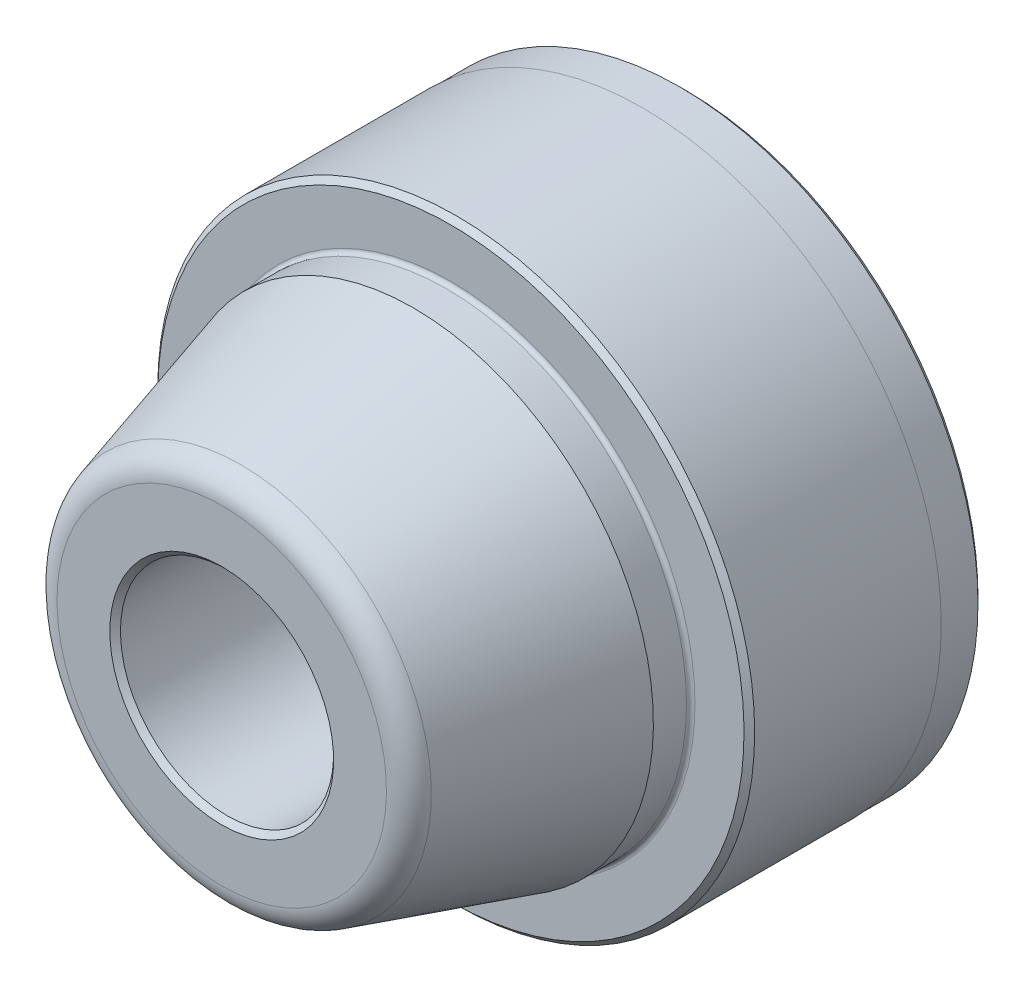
ISO-10303-21;
HEADER;
FILE_DESCRIPTION(('STEP AP214'),'2;1');
FILE_NAME('part.step','',(''),(''),'','','');
FILE_SCHEMA(('AUTOMOTIVE_DESIGN { 1 0 10303 214 1 1 1 1 }'));
ENDSEC;
DATA;
#1=APPLICATION_CONTEXT('core data for automotive mechanical design processes');
#2=APPLICATION_PROTOCOL_DEFINITION('international standard','automotive_design',2000,#1);
#3=PRODUCT_CONTEXT('',#1,'mechanical');
#4=PRODUCT('Part','Part','',(#3));
#5=PRODUCT_RELATED_PRODUCT_CATEGORY('part','',(#4));
#6=PRODUCT_DEFINITION_FORMATION('','',#4);
#7=PRODUCT_DEFINITION_CONTEXT('part definition',#1,'design');
#8=PRODUCT_DEFINITION('design','',#6,#7);
#9=PRODUCT_DEFINITION_SHAPE('','',#8);
#10=(LENGTH_UNIT() NAMED_UNIT(*) SI_UNIT(.MILLI.,.METRE.));
#11=(NAMED_UNIT(*) PLANE_ANGLE_UNIT() SI_UNIT($,.RADIAN.));
#12=(NAMED_UNIT(*) SI_UNIT($,.STERADIAN.) SOLID_ANGLE_UNIT());
#13=UNCERTAINTY_MEASURE_WITH_UNIT(LENGTH_MEASURE(1.E-05),#10,'distance_accuracy_value','');
#14=(GEOMETRIC_REPRESENTATION_CONTEXT(3) GLOBAL_UNCERTAINTY_ASSIGNED_CONTEXT((#13)) GLOBAL_UNIT_ASSIGNED_CONTEXT((#10,
#11,#12)) REPRESENTATION_CONTEXT('',''));
#15=CARTESIAN_POINT('',(0.,0.,0.));
#16=DIRECTION('',(0.,0.,1.));
#17=DIRECTION('',(1.,0.,0.));
#18=AXIS2_PLACEMENT_3D('',#15,#16,#17);
#19=CARTESIAN_POINT('',(0.,0.,2.));
#20=DIRECTION('',(0.,0.,-1.));
#21=DIRECTION('',(0.,1.,0.));
#22=AXIS2_PLACEMENT_3D('',#19,#20,#21);
#23=CONICAL_SURFACE('',#22,7.,0.785398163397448);
#24=CARTESIAN_POINT('',(0.,0.,1.));
#25=DIRECTION('',(0.,0.,-1.));
#26=DIRECTION('',(0.,1.,0.));
#27=AXIS2_PLACEMENT_3D('',#24,#25,#26);
#28=CIRCLE('',#27,8.);
#29=CARTESIAN_POINT('',(0.,8.,1.));
#30=VERTEX_POINT('',#29);
#31=EDGE_CURVE('E71',#30,#30,#28,.F.);
#32=ORIENTED_EDGE('',*,*,#31,.T.);
#33=EDGE_LOOP('',(#32));
#34=FACE_BOUND('',#33,.T.);
#35=CARTESIAN_POINT('',(0.,0.,0.5));
#36=DIRECTION('',(0.,0.,-1.));
#37=DIRECTION('',(0.,1.,0.));
#38=AXIS2_PLACEMENT_3D('',#35,#36,#37);
#39=CIRCLE('',#38,8.5);
#40=CARTESIAN_POINT('',(0.,8.5,0.5));
#41=VERTEX_POINT('',#40);
#42=EDGE_CURVE('E27',#41,#41,#39,.F.);
#43=ORIENTED_EDGE('',*,*,#42,.F.);
#44=EDGE_LOOP('',(#43));
#45=FACE_BOUND('',#44,.T.);
#46=ADVANCED_FACE('F12',(#34,#45),#23,.F.);
#47=CARTESIAN_POINT('',(0.,0.,0.));
#48=DIRECTION('',(0.,0.,-1.));
#49=DIRECTION('',(0.,1.,0.));
#50=AXIS2_PLACEMENT_3D('',#47,#48,#49);
#51=CYLINDRICAL_SURFACE('',#50,28.);
#52=CARTESIAN_POINT('',(0.,0.,21.5));
#53=DIRECTION('',(0.,0.,1.));
#54=DIRECTION('',(0.,-1.,0.));
#55=AXIS2_PLACEMENT_3D('',#52,#53,#54);
#56=CIRCLE('',#55,28.);
#57=CARTESIAN_POINT('',(0.,-28.,21.5));
#58=VERTEX_POINT('',#57);
#59=EDGE_CURVE('E49',#58,#58,#56,.F.);
#60=ORIENTED_EDGE('',*,*,#59,.T.);
#61=EDGE_LOOP('',(#60));
#62=FACE_BOUND('',#61,.T.);
#63=CARTESIAN_POINT('',(0.,0.,4.));
#64=DIRECTION('',(0.,0.,-1.));
#65=DIRECTION('',(0.,1.,0.));
#66=AXIS2_PLACEMENT_3D('',#63,#64,#65);
#67=CIRCLE('',#66,28.);
#68=CARTESIAN_POINT('',(0.,28.,4.));
#69=VERTEX_POINT('',#68);
#70=EDGE_CURVE('E64',#69,#69,#67,.T.);
#71=ORIENTED_EDGE('',*,*,#70,.F.);
#72=EDGE_LOOP('',(#71));
#73=FACE_BOUND('',#72,.T.);
#74=ADVANCED_FACE('F103',(#62,#73),#51,.T.);
#75=CARTESIAN_POINT('',(0.,0.,0.));
#76=DIRECTION('',(0.,0.,-1.));
#77=DIRECTION('',(0.,1.,0.));
#78=AXIS2_PLACEMENT_3D('',#75,#76,#77);
#79=PLANE('',#78);
#80=CARTESIAN_POINT('',(0.,0.,0.));
#81=DIRECTION('',(0.,0.,-1.));
#82=DIRECTION('',(0.,1.,0.));
#83=AXIS2_PLACEMENT_3D('',#80,#81,#82);
#84=CIRCLE('',#83,11.);
#85=CARTESIAN_POINT('',(0.,11.,0.));
#86=VERTEX_POINT('',#85);
#87=EDGE_CURVE('E8',#86,#86,#84,.F.);
#88=ORIENTED_EDGE('',*,*,#87,.T.);
#89=EDGE_LOOP('',(#88));
#90=FACE_BOUND('',#89,.T.);
#91=CARTESIAN_POINT('',(0.,0.,0.));
#92=DIRECTION('',(0.,0.,-1.));
#93=DIRECTION('',(0.,1.,0.));
#94=AXIS2_PLACEMENT_3D('',#91,#92,#93);
#95=CIRCLE('',#94,27.45);
#96=CARTESIAN_POINT('',(0.,27.45,0.));
#97=VERTEX_POINT('',#96);
#98=EDGE_CURVE('E43',#97,#97,#95,.T.);
#99=ORIENTED_EDGE('',*,*,#98,.T.);
#100=EDGE_LOOP('',(#99));
#101=FACE_BOUND('',#100,.T.);
#102=ADVANCED_FACE('F109',(#90,#101),#79,.T.);
#103=CARTESIAN_POINT('',(0.,0.,43.5));
#104=DIRECTION('',(0.,0.,1.));
#105=DIRECTION('',(0.,-1.,0.));
#106=AXIS2_PLACEMENT_3D('',#103,#104,#105);
#107=PLANE('',#106);
#108=CARTESIAN_POINT('',(0.,0.,43.5));
#109=DIRECTION('',(0.,0.,1.));
#110=DIRECTION('',(0.,-1.,0.));
#111=AXIS2_PLACEMENT_3D('',#108,#109,#110);
#112=CIRCLE('',#111,15.4546979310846);
#113=CARTESIAN_POINT('',(0.,-15.4546979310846,43.5));
#114=VERTEX_POINT('',#113);
#115=EDGE_CURVE('E20',#114,#114,#112,.T.);
#116=ORIENTED_EDGE('',*,*,#115,.T.);
#117=EDGE_LOOP('',(#116));
#118=FACE_BOUND('',#117,.T.);
#119=CARTESIAN_POINT('',(0.,0.,43.5));
#120=DIRECTION('',(0.,0.,1.));
#121=DIRECTION('',(0.,-1.,0.));
#122=AXIS2_PLACEMENT_3D('',#119,#120,#121);
#123=CIRCLE('',#122,10.5);
#124=CARTESIAN_POINT('',(0.,-10.5,43.5));
#125=VERTEX_POINT('',#124);
#126=EDGE_CURVE('E52',#125,#125,#123,.F.);
#127=ORIENTED_EDGE('',*,*,#126,.T.);
#128=EDGE_LOOP('',(#127));
#129=FACE_BOUND('',#128,.T.);
#130=ADVANCED_FACE('F117',(#118,#129),#107,.T.);
#131=CARTESIAN_POINT('',(0.,0.,25.5));
#132=DIRECTION('',(0.,0.,-1.));
#133=DIRECTION('',(0.,1.,0.));
#134=AXIS2_PLACEMENT_3D('',#131,#132,#133);
#135=CONICAL_SURFACE('',#134,22.5,0.279252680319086);
#136=CARTESIAN_POINT('',(0.,0.,41.6890933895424));
#137=DIRECTION('',(0.,0.,1.));
#138=DIRECTION('',(0.,-1.,0.));
#139=AXIS2_PLACEMENT_3D('',#136,#137,#138);
#140=CIRCLE('',#139,17.8578521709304);
#141=CARTESIAN_POINT('',(0.,-17.8578521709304,41.6890933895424));
#142=VERTEX_POINT('',#141);
#143=EDGE_CURVE('E24',#142,#142,#140,.F.);
#144=ORIENTED_EDGE('',*,*,#143,.T.);
#145=EDGE_LOOP('',(#144));
#146=FACE_BOUND('',#145,.T.);
#147=CARTESIAN_POINT('',(0.,0.,25.5));
#148=DIRECTION('',(0.,0.,-1.));
#149=DIRECTION('',(0.,1.,0.));
#150=AXIS2_PLACEMENT_3D('',#147,#148,#149);
#151=CIRCLE('',#150,22.5);
#152=CARTESIAN_POINT('',(0.,22.5,25.5));
#153=VERTEX_POINT('',#152);
#154=EDGE_CURVE('E58',#153,#153,#151,.T.);
#155=ORIENTED_EDGE('',*,*,#154,.F.);
#156=EDGE_LOOP('',(#155));
#157=FACE_BOUND('',#156,.T.);
#158=ADVANCED_FACE('F126',(#146,#157),#135,.T.);
#159=CARTESIAN_POINT('',(0.,0.,0.));
#160=DIRECTION('',(0.,0.,-1.));
#161=DIRECTION('',(0.,1.,0.));
#162=AXIS2_PLACEMENT_3D('',#159,#160,#161);
#163=CYLINDRICAL_SURFACE('',#162,22.5);
#164=CARTESIAN_POINT('',(0.,0.,22.4));
#165=DIRECTION('',(0.,0.,1.));
#166=DIRECTION('',(0.,-1.,0.));
#167=AXIS2_PLACEMENT_3D('',#164,#165,#166);
#168=CIRCLE('',#167,22.5);
#169=CARTESIAN_POINT('',(0.,-22.5,22.4));
#170=VERTEX_POINT('',#169);
#171=EDGE_CURVE('E34',#170,#170,#168,.T.);
#172=ORIENTED_EDGE('',*,*,#171,.T.);
#173=EDGE_LOOP('',(#172));
#174=FACE_BOUND('',#173,.T.);
#175=ORIENTED_EDGE('',*,*,#154,.T.);
#176=EDGE_LOOP('',(#175));
#177=FACE_BOUND('',#176,.T.);
#178=ADVANCED_FACE('F122',(#174,#177),#163,.T.);
#179=CARTESIAN_POINT('',(22.5,0.,22.));
#180=DIRECTION('',(0.,0.,1.));
#181=DIRECTION('',(0.,-1.,0.));
#182=AXIS2_PLACEMENT_3D('',#179,#180,#181);
#183=PLANE('',#182);
#184=CARTESIAN_POINT('',(0.,0.,22.));
#185=DIRECTION('',(0.,0.,1.));
#186=DIRECTION('',(0.,-1.,0.));
#187=AXIS2_PLACEMENT_3D('',#184,#185,#186);
#188=CIRCLE('',#187,22.9);
#189=CARTESIAN_POINT('',(0.,-22.9,22.));
#190=VERTEX_POINT('',#189);
#191=EDGE_CURVE('E37',#190,#190,#188,.F.);
#192=ORIENTED_EDGE('',*,*,#191,.T.);
#193=EDGE_LOOP('',(#192));
#194=FACE_BOUND('',#193,.T.);
#195=CARTESIAN_POINT('',(0.,0.,22.));
#196=DIRECTION('',(0.,0.,1.));
#197=DIRECTION('',(0.,-1.,0.));
#198=AXIS2_PLACEMENT_3D('',#195,#196,#197);
#199=CIRCLE('',#198,27.5);
#200=CARTESIAN_POINT('',(0.,-27.5,22.));
#201=VERTEX_POINT('',#200);
#202=EDGE_CURVE('E46',#201,#201,#199,.T.);
#203=ORIENTED_EDGE('',*,*,#202,.T.);
#204=EDGE_LOOP('',(#203));
#205=FACE_BOUND('',#204,.T.);
#206=ADVANCED_FACE('F119',(#194,#205),#183,.T.);
#207=CARTESIAN_POINT('',(0.,0.,0.));
#208=DIRECTION('',(0.,0.,-1.));
#209=DIRECTION('',(0.,1.,0.));
#210=AXIS2_PLACEMENT_3D('',#207,#208,#209);
#211=CYLINDRICAL_SURFACE('',#210,27.95);
#212=CARTESIAN_POINT('',(0.,0.,0.5));
#213=DIRECTION('',(0.,0.,-1.));
#214=DIRECTION('',(0.,1.,0.));
#215=AXIS2_PLACEMENT_3D('',#212,#213,#214);
#216=CIRCLE('',#215,27.95);
#217=CARTESIAN_POINT('',(0.,27.95,0.5));
#218=VERTEX_POINT('',#217);
#219=EDGE_CURVE('E40',#218,#218,#216,.F.);
#220=ORIENTED_EDGE('',*,*,#219,.T.);
#221=EDGE_LOOP('',(#220));
#222=FACE_BOUND('',#221,.T.);
#223=CARTESIAN_POINT('',(0.,0.,4.));
#224=DIRECTION('',(0.,0.,-1.));
#225=DIRECTION('',(0.,1.,0.));
#226=AXIS2_PLACEMENT_3D('',#223,#224,#225);
#227=CIRCLE('',#226,27.95);
#228=CARTESIAN_POINT('',(0.,27.95,4.));
#229=VERTEX_POINT('',#228);
#230=EDGE_CURVE('E61',#229,#229,#227,.T.);
#231=ORIENTED_EDGE('',*,*,#230,.T.);
#232=EDGE_LOOP('',(#231));
#233=FACE_BOUND('',#232,.T.);
#234=ADVANCED_FACE('F115',(#222,#233),#211,.T.);
#235=CARTESIAN_POINT('',(-27.95,0.,4.));
#236=DIRECTION('',(0.,0.,-1.));
#237=DIRECTION('',(0.,1.,0.));
#238=AXIS2_PLACEMENT_3D('',#235,#236,#237);
#239=PLANE('',#238);
#240=ORIENTED_EDGE('',*,*,#70,.T.);
#241=EDGE_LOOP('',(#240));
#242=FACE_BOUND('',#241,.T.);
#243=ORIENTED_EDGE('',*,*,#230,.F.);
#244=EDGE_LOOP('',(#243));
#245=FACE_BOUND('',#244,.T.);
#246=ADVANCED_FACE('F85',(#242,#245),#239,.T.);
#247=CARTESIAN_POINT('',(0.,0.,28.5));
#248=DIRECTION('',(0.,0.,1.));
#249=DIRECTION('',(0.,-1.,0.));
#250=AXIS2_PLACEMENT_3D('',#247,#248,#249);
#251=PLANE('',#250);
#252=CARTESIAN_POINT('',(0.,0.,28.5));
#253=DIRECTION('',(0.,0.,1.));
#254=DIRECTION('',(0.,-1.,0.));
#255=AXIS2_PLACEMENT_3D('',#252,#253,#254);
#256=CIRCLE('',#255,8.);
#257=CARTESIAN_POINT('',(0.,-8.,28.5));
#258=VERTEX_POINT('',#257);
#259=EDGE_CURVE('E16',#258,#258,#256,.T.);
#260=ORIENTED_EDGE('',*,*,#259,.F.);
#261=EDGE_LOOP('',(#260));
#262=FACE_BOUND('',#261,.T.);
#263=CARTESIAN_POINT('',(0.,0.,28.5));
#264=DIRECTION('',(0.,0.,1.));
#265=DIRECTION('',(0.,-1.,0.));
#266=AXIS2_PLACEMENT_3D('',#263,#264,#265);
#267=CIRCLE('',#266,10.);
#268=CARTESIAN_POINT('',(0.,-10.,28.5));
#269=VERTEX_POINT('',#268);
#270=EDGE_CURVE('E29',#269,#269,#267,.T.);
#271=ORIENTED_EDGE('',*,*,#270,.T.);
#272=EDGE_LOOP('',(#271));
#273=FACE_BOUND('',#272,.T.);
#274=ADVANCED_FACE('F81',(#262,#273),#251,.T.);
#275=CARTESIAN_POINT('',(0.,0.,28.5));
#276=DIRECTION('',(0.,0.,1.));
#277=DIRECTION('',(0.,-1.,0.));
#278=AXIS2_PLACEMENT_3D('',#275,#276,#277);
#279=CYLINDRICAL_SURFACE('',#278,10.);
#280=CARTESIAN_POINT('',(0.,0.,43.));
#281=DIRECTION('',(0.,0.,1.));
#282=DIRECTION('',(0.,-1.,0.));
#283=AXIS2_PLACEMENT_3D('',#280,#281,#282);
#284=CIRCLE('',#283,10.);
#285=CARTESIAN_POINT('',(0.,-10.,43.));
#286=VERTEX_POINT('',#285);
#287=EDGE_CURVE('E55',#286,#286,#284,.T.);
#288=ORIENTED_EDGE('',*,*,#287,.T.);
#289=EDGE_LOOP('',(#288));
#290=FACE_BOUND('',#289,.T.);
#291=ORIENTED_EDGE('',*,*,#270,.F.);
#292=EDGE_LOOP('',(#291));
#293=FACE_BOUND('',#292,.T.);
#294=ADVANCED_FACE('F84',(#290,#293),#279,.F.);
#295=CARTESIAN_POINT('',(0.,0.,43.));
#296=DIRECTION('',(0.,0.,1.));
#297=DIRECTION('',(0.,-1.,0.));
#298=AXIS2_PLACEMENT_3D('',#295,#296,#297);
#299=CONICAL_SURFACE('',#298,10.,0.785398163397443);
#300=ORIENTED_EDGE('',*,*,#126,.F.);
#301=EDGE_LOOP('',(#300));
#302=FACE_BOUND('',#301,.T.);
#303=ORIENTED_EDGE('',*,*,#287,.F.);
#304=EDGE_LOOP('',(#303));
#305=FACE_BOUND('',#304,.T.);
#306=ADVANCED_FACE('F90',(#302,#305),#299,.F.);
#307=CARTESIAN_POINT('',(0.,0.,21.5));
#308=DIRECTION('',(0.,0.,-1.));
#309=DIRECTION('',(0.,1.,0.));
#310=AXIS2_PLACEMENT_3D('',#307,#308,#309);
#311=CONICAL_SURFACE('',#310,28.,0.785398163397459);
#312=ORIENTED_EDGE('',*,*,#202,.F.);
#313=EDGE_LOOP('',(#312));
#314=FACE_BOUND('',#313,.T.);
#315=ORIENTED_EDGE('',*,*,#59,.F.);
#316=EDGE_LOOP('',(#315));
#317=FACE_BOUND('',#316,.T.);
#318=ADVANCED_FACE('F98',(#314,#317),#311,.T.);
#319=CARTESIAN_POINT('',(0.,0.,0.));
#320=DIRECTION('',(0.,0.,1.));
#321=DIRECTION('',(0.,-1.,0.));
#322=AXIS2_PLACEMENT_3D('',#319,#320,#321);
#323=CONICAL_SURFACE('',#322,27.45,0.785398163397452);
#324=ORIENTED_EDGE('',*,*,#219,.F.);
#325=EDGE_LOOP('',(#324));
#326=FACE_BOUND('',#325,.T.);
#327=ORIENTED_EDGE('',*,*,#98,.F.);
#328=EDGE_LOOP('',(#327));
#329=FACE_BOUND('',#328,.T.);
#330=ADVANCED_FACE('F136',(#326,#329),#323,.T.);
#331=CARTESIAN_POINT('',(0.,0.,22.4));
#332=DIRECTION('',(0.,0.,1.));
#333=DIRECTION('',(0.,-1.,0.));
#334=AXIS2_PLACEMENT_3D('',#331,#332,#333);
#335=TOROIDAL_SURFACE('',#334,22.9,0.4);
#336=ORIENTED_EDGE('',*,*,#171,.F.);
#337=EDGE_LOOP('',(#336));
#338=FACE_BOUND('',#337,.T.);
#339=ORIENTED_EDGE('',*,*,#191,.F.);
#340=EDGE_LOOP('',(#339));
#341=FACE_BOUND('',#340,.T.);
#342=ADVANCED_FACE('F140',(#338,#341),#335,.F.);
#343=CARTESIAN_POINT('',(0.,0.,41.));
#344=DIRECTION('',(0.,0.,1.));
#345=DIRECTION('',(0.,-1.,0.));
#346=AXIS2_PLACEMENT_3D('',#343,#344,#345);
#347=TOROIDAL_SURFACE('',#346,15.4546979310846,2.5);
#348=ORIENTED_EDGE('',*,*,#115,.F.);
#349=EDGE_LOOP('',(#348));
#350=FACE_BOUND('',#349,.T.);
#351=ORIENTED_EDGE('',*,*,#143,.F.);
#352=EDGE_LOOP('',(#351));
#353=FACE_BOUND('',#352,.T.);
#354=ADVANCED_FACE('F143',(#350,#353),#347,.T.);
#355=CARTESIAN_POINT('',(0.,0.,0.5));
#356=DIRECTION('',(0.,0.,-1.));
#357=DIRECTION('',(0.,1.,0.));
#358=AXIS2_PLACEMENT_3D('',#355,#356,#357);
#359=PLANE('',#358);
#360=CARTESIAN_POINT('',(0.,0.,0.5));
#361=DIRECTION('',(0.,0.,-1.));
#362=DIRECTION('',(0.,1.,0.));
#363=AXIS2_PLACEMENT_3D('',#360,#361,#362);
#364=CIRCLE('',#363,10.5);
#365=CARTESIAN_POINT('',(0.,10.5,0.5));
#366=VERTEX_POINT('',#365);
#367=EDGE_CURVE('E30',#366,#366,#364,.T.);
#368=ORIENTED_EDGE('',*,*,#367,.T.);
#369=EDGE_LOOP('',(#368));
#370=FACE_BOUND('',#369,.T.);
#371=ORIENTED_EDGE('',*,*,#42,.T.);
#372=EDGE_LOOP('',(#371));
#373=FACE_BOUND('',#372,.T.);
#374=ADVANCED_FACE('F146',(#370,#373),#359,.T.);
#375=CARTESIAN_POINT('',(0.,0.,0.5));
#376=DIRECTION('',(0.,0.,-1.));
#377=DIRECTION('',(0.,1.,0.));
#378=AXIS2_PLACEMENT_3D('',#375,#376,#377);
#379=CONICAL_SURFACE('',#378,10.5,0.785398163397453);
#380=ORIENTED_EDGE('',*,*,#87,.F.);
#381=EDGE_LOOP('',(#380));
#382=FACE_BOUND('',#381,.T.);
#383=ORIENTED_EDGE('',*,*,#367,.F.);
#384=EDGE_LOOP('',(#383));
#385=FACE_BOUND('',#384,.T.);
#386=ADVANCED_FACE('F14',(#382,#385),#379,.F.);
#387=CARTESIAN_POINT('',(0.,0.,43.5));
#388=DIRECTION('',(0.,0.,-1.));
#389=DIRECTION('',(0.,1.,0.));
#390=AXIS2_PLACEMENT_3D('',#387,#388,#389);
#391=CYLINDRICAL_SURFACE('',#390,8.);
#392=ORIENTED_EDGE('',*,*,#259,.T.);
#393=EDGE_LOOP('',(#392));
#394=FACE_BOUND('',#393,.T.);
#395=ORIENTED_EDGE('',*,*,#31,.F.);
#396=EDGE_LOOP('',(#395));
#397=FACE_BOUND('',#396,.T.);
#398=ADVANCED_FACE('F78',(#394,#397),#391,.F.);
#399=CLOSED_SHELL('',(#46,#74,#102,#130,#158,#178,#206,#234,#246,#274,#294,#306,#318,#330,#342,
#354,#374,#386,#398));
#400=MANIFOLD_SOLID_BREP('B1',#399);
#401=ADVANCED_BREP_SHAPE_REPRESENTATION('',(#18,#400),#14);
#402=SHAPE_DEFINITION_REPRESENTATION(#9,#401);
ENDSEC;
END-ISO-10303-21;
